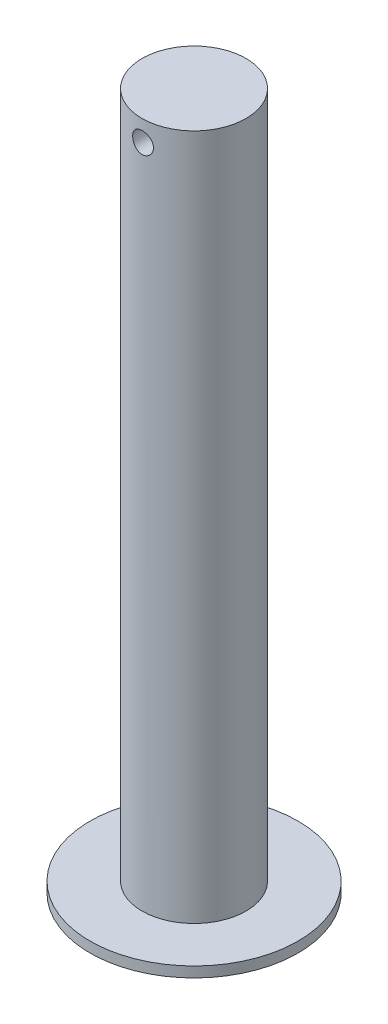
ISO-10303-21;
HEADER;
FILE_DESCRIPTION(('STEP AP214'),'2;1');
FILE_NAME('part.step','',(''),(''),'','','');
FILE_SCHEMA(('AUTOMOTIVE_DESIGN { 1 0 10303 214 1 1 1 1 }'));
ENDSEC;
DATA;
#1=APPLICATION_CONTEXT('core data for automotive mechanical design processes');
#2=APPLICATION_PROTOCOL_DEFINITION('international standard','automotive_design',2000,#1);
#3=PRODUCT_CONTEXT('',#1,'mechanical');
#4=PRODUCT('Part','Part','',(#3));
#5=PRODUCT_RELATED_PRODUCT_CATEGORY('part','',(#4));
#6=PRODUCT_DEFINITION_FORMATION('','',#4);
#7=PRODUCT_DEFINITION_CONTEXT('part definition',#1,'design');
#8=PRODUCT_DEFINITION('design','',#6,#7);
#9=PRODUCT_DEFINITION_SHAPE('','',#8);
#10=(LENGTH_UNIT() NAMED_UNIT(*) SI_UNIT(.MILLI.,.METRE.));
#11=(NAMED_UNIT(*) PLANE_ANGLE_UNIT() SI_UNIT($,.RADIAN.));
#12=(NAMED_UNIT(*) SI_UNIT($,.STERADIAN.) SOLID_ANGLE_UNIT());
#13=UNCERTAINTY_MEASURE_WITH_UNIT(LENGTH_MEASURE(1.E-05),#10,'distance_accuracy_value','');
#14=(GEOMETRIC_REPRESENTATION_CONTEXT(3) GLOBAL_UNCERTAINTY_ASSIGNED_CONTEXT((#13)) GLOBAL_UNIT_ASSIGNED_CONTEXT((#10,
#11,#12)) REPRESENTATION_CONTEXT('',''));
#15=CARTESIAN_POINT('',(0.,0.,0.));
#16=DIRECTION('',(0.,0.,1.));
#17=DIRECTION('',(1.,0.,0.));
#18=AXIS2_PLACEMENT_3D('',#15,#16,#17);
#19=CARTESIAN_POINT('',(0.,-1.27,0.));
#20=DIRECTION('',(0.,-1.,0.));
#21=DIRECTION('',(0.,0.,-1.));
#22=AXIS2_PLACEMENT_3D('',#19,#20,#21);
#23=CONICAL_SURFACE('',#22,10.31875,0.785398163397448);
#24=CARTESIAN_POINT('',(0.,0.,0.));
#25=DIRECTION('',(0.,1.,0.));
#26=DIRECTION('',(0.,0.,1.));
#27=AXIS2_PLACEMENT_3D('',#24,#25,#26);
#28=CIRCLE('',#27,9.04875000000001);
#29=CARTESIAN_POINT('',(0.,0.,9.04875000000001));
#30=VERTEX_POINT('',#29);
#31=EDGE_CURVE('E44',#30,#30,#28,.F.);
#32=ORIENTED_EDGE('',*,*,#31,.F.);
#33=EDGE_LOOP('',(#32));
#34=FACE_BOUND('',#33,.T.);
#35=CARTESIAN_POINT('',(0.,-1.27,0.));
#36=DIRECTION('',(0.,-1.,0.));
#37=DIRECTION('',(0.,0.,-1.));
#38=AXIS2_PLACEMENT_3D('',#35,#36,#37);
#39=CIRCLE('',#38,10.31875);
#40=CARTESIAN_POINT('',(0.,-1.27,-10.31875));
#41=VERTEX_POINT('',#40);
#42=EDGE_CURVE('E11',#41,#41,#39,.T.);
#43=ORIENTED_EDGE('',*,*,#42,.T.);
#44=EDGE_LOOP('',(#43));
#45=FACE_BOUND('',#44,.T.);
#46=ADVANCED_FACE('F38',(#34,#45),#23,.F.);
#47=CARTESIAN_POINT('',(0.,-2.54,0.));
#48=DIRECTION('',(0.,1.,0.));
#49=DIRECTION('',(0.,0.,1.));
#50=AXIS2_PLACEMENT_3D('',#47,#48,#49);
#51=CYLINDRICAL_SURFACE('',#50,10.31875);
#52=CARTESIAN_POINT('',(0.,0.,0.));
#53=DIRECTION('',(0.,1.,0.));
#54=DIRECTION('',(0.,0.,1.));
#55=AXIS2_PLACEMENT_3D('',#52,#53,#54);
#56=CIRCLE('',#55,10.31875);
#57=CARTESIAN_POINT('',(0.,0.,10.31875));
#58=VERTEX_POINT('',#57);
#59=EDGE_CURVE('E48',#58,#58,#56,.T.);
#60=ORIENTED_EDGE('',*,*,#59,.F.);
#61=EDGE_LOOP('',(#60));
#62=FACE_BOUND('',#61,.T.);
#63=ORIENTED_EDGE('',*,*,#42,.F.);
#64=EDGE_LOOP('',(#63));
#65=FACE_BOUND('',#64,.T.);
#66=ADVANCED_FACE('F57',(#62,#65),#51,.T.);
#67=CARTESIAN_POINT('',(0.,0.,0.));
#68=DIRECTION('',(0.,1.,0.));
#69=DIRECTION('',(0.,0.,1.));
#70=AXIS2_PLACEMENT_3D('',#67,#68,#69);
#71=PLANE('',#70);
#72=ORIENTED_EDGE('',*,*,#59,.T.);
#73=EDGE_LOOP('',(#72));
#74=FACE_BOUND('',#73,.T.);
#75=ORIENTED_EDGE('',*,*,#31,.T.);
#76=EDGE_LOOP('',(#75));
#77=FACE_BOUND('',#76,.T.);
#78=ADVANCED_FACE('F55',(#74,#77),#71,.T.);
#79=CLOSED_SHELL('',(#46,#66,#78));
#80=MANIFOLD_SOLID_BREP('B2',#79);
#81=CARTESIAN_POINT('',(0.,-2.54,0.));
#82=DIRECTION('',(0.,-1.,0.));
#83=DIRECTION('',(0.,0.,-1.));
#84=AXIS2_PLACEMENT_3D('',#81,#82,#83);
#85=PLANE('',#84);
#86=CARTESIAN_POINT('',(0.,-2.54,0.));
#87=DIRECTION('',(0.,-1.,0.));
#88=DIRECTION('',(0.,0.,-1.));
#89=AXIS2_PLACEMENT_3D('',#86,#87,#88);
#90=CIRCLE('',#89,25.4);
#91=CARTESIAN_POINT('',(0.,-2.54,-25.4));
#92=VERTEX_POINT('',#91);
#93=EDGE_CURVE('E37',#92,#92,#90,.T.);
#94=ORIENTED_EDGE('',*,*,#93,.T.);
#95=EDGE_LOOP('',(#94));
#96=FACE_BOUND('',#95,.T.);
#97=CARTESIAN_POINT('',(0.,-2.54,0.));
#98=DIRECTION('',(0.,-1.,0.));
#99=DIRECTION('',(0.,0.,-1.));
#100=AXIS2_PLACEMENT_3D('',#97,#98,#99);
#101=CIRCLE('',#100,10.31875);
#102=CARTESIAN_POINT('',(0.,-2.54,-10.31875));
#103=VERTEX_POINT('',#102);
#104=EDGE_CURVE('E103',#103,#103,#101,.T.);
#105=ORIENTED_EDGE('',*,*,#104,.F.);
#106=EDGE_LOOP('',(#105));
#107=FACE_BOUND('',#106,.T.);
#108=ADVANCED_FACE('F92',(#96,#107),#85,.T.);
#109=CARTESIAN_POINT('',(0.,0.,0.));
#110=DIRECTION('',(0.,-1.,0.));
#111=DIRECTION('',(0.,0.,-1.));
#112=AXIS2_PLACEMENT_3D('',#109,#110,#111);
#113=PLANE('',#112);
#114=CARTESIAN_POINT('',(0.,0.,0.));
#115=DIRECTION('',(0.,-1.,0.));
#116=DIRECTION('',(0.,0.,-1.));
#117=AXIS2_PLACEMENT_3D('',#114,#115,#116);
#118=CIRCLE('',#117,25.4);
#119=CARTESIAN_POINT('',(0.,0.,-25.4));
#120=VERTEX_POINT('',#119);
#121=EDGE_CURVE('E96',#120,#120,#118,.T.);
#122=ORIENTED_EDGE('',*,*,#121,.F.);
#123=EDGE_LOOP('',(#122));
#124=FACE_BOUND('',#123,.T.);
#125=CARTESIAN_POINT('',(0.,0.,0.));
#126=DIRECTION('',(0.,-1.,0.));
#127=DIRECTION('',(0.,0.,-1.));
#128=AXIS2_PLACEMENT_3D('',#125,#126,#127);
#129=CIRCLE('',#128,10.31875);
#130=CARTESIAN_POINT('',(0.,0.,-10.31875));
#131=VERTEX_POINT('',#130);
#132=EDGE_CURVE('E105',#131,#131,#129,.T.);
#133=ORIENTED_EDGE('',*,*,#132,.T.);
#134=EDGE_LOOP('',(#133));
#135=FACE_BOUND('',#134,.T.);
#136=ADVANCED_FACE('F115',(#124,#135),#113,.F.);
#137=CARTESIAN_POINT('',(0.,-2.54,0.));
#138=DIRECTION('',(0.,1.,0.));
#139=DIRECTION('',(0.,0.,1.));
#140=AXIS2_PLACEMENT_3D('',#137,#138,#139);
#141=CYLINDRICAL_SURFACE('',#140,25.4);
#142=ORIENTED_EDGE('',*,*,#93,.F.);
#143=EDGE_LOOP('',(#142));
#144=FACE_BOUND('',#143,.T.);
#145=ORIENTED_EDGE('',*,*,#121,.T.);
#146=EDGE_LOOP('',(#145));
#147=FACE_BOUND('',#146,.T.);
#148=ADVANCED_FACE('F94',(#144,#147),#141,.T.);
#149=CARTESIAN_POINT('',(0.,-2.54,0.));
#150=DIRECTION('',(0.,1.,0.));
#151=DIRECTION('',(0.,0.,1.));
#152=AXIS2_PLACEMENT_3D('',#149,#150,#151);
#153=CYLINDRICAL_SURFACE('',#152,10.31875);
#154=ORIENTED_EDGE('',*,*,#104,.T.);
#155=EDGE_LOOP('',(#154));
#156=FACE_BOUND('',#155,.T.);
#157=ORIENTED_EDGE('',*,*,#132,.F.);
#158=EDGE_LOOP('',(#157));
#159=FACE_BOUND('',#158,.T.);
#160=ADVANCED_FACE('F111',(#156,#159),#153,.F.);
#161=CLOSED_SHELL('',(#108,#136,#148,#160));
#162=MANIFOLD_SOLID_BREP('B6',#161);
#163=CARTESIAN_POINT('',(0.,167.64,0.));
#164=DIRECTION('',(0.,-1.,0.));
#165=DIRECTION('',(0.,0.,-1.));
#166=AXIS2_PLACEMENT_3D('',#163,#164,#165);
#167=CYLINDRICAL_SURFACE('',#166,12.7);
#168=CARTESIAN_POINT('',(0.,165.1,-12.7));
#169=CARTESIAN_POINT('',(-0.141165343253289,165.099994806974,-12.6999973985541));
#170=CARTESIAN_POINT('',(-0.282396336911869,165.088191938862,-12.6976221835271));
#171=CARTESIAN_POINT('',(-0.560866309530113,165.041329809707,-12.6883760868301));
#172=CARTESIAN_POINT('',(-0.698102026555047,165.006252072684,-12.6815016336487));
#173=CARTESIAN_POINT('',(-0.96451497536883,164.913967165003,-12.6640246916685));
#174=CARTESIAN_POINT('',(-1.09369978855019,164.856781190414,-12.6534257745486));
#175=CARTESIAN_POINT('',(-1.34063229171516,164.721966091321,-12.629652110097));
#176=CARTESIAN_POINT('',(-1.45838066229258,164.644338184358,-12.616477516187));
#177=CARTESIAN_POINT('',(-1.68070143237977,164.4697282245,-12.5888029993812));
#178=CARTESIAN_POINT('',(-1.78509663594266,164.372522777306,-12.5742889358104));
#179=CARTESIAN_POINT('',(-1.9762133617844,164.161997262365,-12.5456741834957));
#180=CARTESIAN_POINT('',(-2.0629335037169,164.048675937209,-12.5315735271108));
#181=CARTESIAN_POINT('',(-2.21699265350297,163.80786086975,-12.5052440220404));
#182=CARTESIAN_POINT('',(-2.28414818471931,163.680247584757,-12.4930333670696));
#183=CARTESIAN_POINT('',(-2.39599639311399,163.41526417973,-12.4720672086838));
#184=CARTESIAN_POINT('',(-2.4406912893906,163.2778950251,-12.4633113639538));
#185=CARTESIAN_POINT('',(-2.50577426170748,162.999205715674,-12.450389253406));
#186=CARTESIAN_POINT('',(-2.52647322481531,162.857960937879,-12.4461643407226));
#187=CARTESIAN_POINT('',(-2.54394240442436,162.573945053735,-12.4426059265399));
#188=CARTESIAN_POINT('',(-2.54071506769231,162.431174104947,-12.4432719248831));
#189=CARTESIAN_POINT('',(-2.51067461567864,162.150433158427,-12.4493667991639));
#190=CARTESIAN_POINT('',(-2.48421789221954,162.012423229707,-12.4547237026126));
#191=CARTESIAN_POINT('',(-2.40903222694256,161.742841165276,-12.469483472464));
#192=CARTESIAN_POINT('',(-2.36030222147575,161.611269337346,-12.4788865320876));
#193=CARTESIAN_POINT('',(-2.24161295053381,161.357271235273,-12.5007527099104));
#194=CARTESIAN_POINT('',(-2.17151242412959,161.234912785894,-12.5132360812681));
#195=CARTESIAN_POINT('',(-2.01217167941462,161.003562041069,-12.5398433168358));
#196=CARTESIAN_POINT('',(-1.92292926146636,160.894571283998,-12.5539673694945));
#197=CARTESIAN_POINT('',(-1.7259298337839,160.690993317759,-12.5825763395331));
#198=CARTESIAN_POINT('',(-1.61786864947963,160.596700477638,-12.597063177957));
#199=CARTESIAN_POINT('',(-1.38730996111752,160.427533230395,-12.624532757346));
#200=CARTESIAN_POINT('',(-1.26481227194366,160.352659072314,-12.6375154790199));
#201=CARTESIAN_POINT('',(-1.00853084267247,160.224400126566,-12.6605459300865));
#202=CARTESIAN_POINT('',(-0.874729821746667,160.171048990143,-12.6705890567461));
#203=CARTESIAN_POINT('',(-0.59981840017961,160.087664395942,-12.6865737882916));
#204=CARTESIAN_POINT('',(-0.458708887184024,160.057628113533,-12.6925158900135));
#205=CARTESIAN_POINT('',(-0.175715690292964,160.022142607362,-12.6995598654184));
#206=CARTESIAN_POINT('',(-0.0338844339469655,160.016290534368,-12.7007410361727));
#207=CARTESIAN_POINT('',(0.248729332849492,160.028254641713,-12.6983503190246));
#208=CARTESIAN_POINT('',(0.389511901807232,160.046069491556,-12.6947786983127));
#209=CARTESIAN_POINT('',(0.664732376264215,160.104527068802,-12.6833333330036));
#210=CARTESIAN_POINT('',(0.799215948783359,160.144963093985,-12.6754985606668));
#211=CARTESIAN_POINT('',(1.05949401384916,160.247289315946,-12.6564022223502));
#212=CARTESIAN_POINT('',(1.18528785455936,160.309181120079,-12.6451403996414));
#213=CARTESIAN_POINT('',(1.426314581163,160.453533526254,-12.6202417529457));
#214=CARTESIAN_POINT('',(1.54139932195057,160.536236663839,-12.6065775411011));
#215=CARTESIAN_POINT('',(1.7562017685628,160.719539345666,-12.578454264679));
#216=CARTESIAN_POINT('',(1.85591782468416,160.820140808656,-12.5639951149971));
#217=CARTESIAN_POINT('',(2.03870710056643,161.038218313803,-12.5356443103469));
#218=CARTESIAN_POINT('',(2.12150376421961,161.155927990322,-12.5217646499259));
#219=CARTESIAN_POINT('',(2.26615096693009,161.403820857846,-12.4963984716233));
#220=CARTESIAN_POINT('',(2.3280023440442,161.534003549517,-12.4849118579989));
#221=CARTESIAN_POINT('',(2.4286256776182,161.80249134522,-12.4657292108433));
#222=CARTESIAN_POINT('',(2.46751728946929,161.940750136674,-12.4580135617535));
#223=CARTESIAN_POINT('',(2.5214799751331,162.222010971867,-12.4472048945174));
#224=CARTESIAN_POINT('',(2.5365541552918,162.365012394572,-12.4441112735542));
#225=CARTESIAN_POINT('',(2.54233911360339,162.648922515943,-12.442930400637));
#226=CARTESIAN_POINT('',(2.53348690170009,162.789822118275,-12.4447533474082));
#227=CARTESIAN_POINT('',(2.49263485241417,163.068080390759,-12.4529995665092));
#228=CARTESIAN_POINT('',(2.46063520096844,163.205439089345,-12.4594228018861));
#229=CARTESIAN_POINT('',(2.37459156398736,163.472438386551,-12.4761057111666));
#230=CARTESIAN_POINT('',(2.32060116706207,163.602096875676,-12.4863560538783));
#231=CARTESIAN_POINT('',(2.19215879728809,163.850583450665,-12.5095435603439));
#232=CARTESIAN_POINT('',(2.11770510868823,163.969410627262,-12.5224809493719));
#233=CARTESIAN_POINT('',(1.94895702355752,164.195037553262,-12.5498595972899));
#234=CARTESIAN_POINT('',(1.85434703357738,164.30159866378,-12.5643226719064));
#235=CARTESIAN_POINT('',(1.64862349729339,164.497476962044,-12.5929664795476));
#236=CARTESIAN_POINT('',(1.53750616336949,164.586790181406,-12.6071471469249));
#237=CARTESIAN_POINT('',(1.30052477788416,164.746519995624,-12.6338033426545));
#238=CARTESIAN_POINT('',(1.17451856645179,164.816729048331,-12.6462594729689));
#239=CARTESIAN_POINT('',(0.912282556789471,164.934864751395,-12.667872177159));
#240=CARTESIAN_POINT('',(0.776062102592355,164.982811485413,-12.6770317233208));
#241=CARTESIAN_POINT('',(0.532946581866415,165.045775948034,-12.6892398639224));
#242=CARTESIAN_POINT('',(0.427435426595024,165.066073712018,-12.6932513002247));
#243=CARTESIAN_POINT('',(0.214628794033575,165.09318749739,-12.6986323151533));
#244=CARTESIAN_POINT('',(0.107333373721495,165.100003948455,-12.7000019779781));
#245=CARTESIAN_POINT('',(0.,165.1,-12.7));
#246=B_SPLINE_CURVE_WITH_KNOTS('',3,(#168,#169,#170,#171,#172,#173,#174,#175,#176,#177,#178,
#179,#180,#181,#182,#183,#184,#185,#186,#187,#188,#189,#190,#191,#192,#193,#194,#195,#196,#197,
#198,#199,#200,#201,#202,#203,#204,#205,#206,#207,#208,#209,#210,#211,#212,#213,#214,#215,#216,
#217,#218,#219,#220,#221,#222,#223,#224,#225,#226,#227,#228,#229,#230,#231,#232,#233,#234,#235,
#236,#237,#238,#239,#240,#241,#242,#243,#244,#245),.UNSPECIFIED.,.T.,.F.,(4,2,2,2,2,2,2,2,2,2,2,
2,2,2,2,2,2,2,2,2,2,2,2,2,2,2,2,2,2,2,2,2,2,2,2,2,2,2,4),(0.,0.423103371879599,
0.846543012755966,1.26957768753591,1.69258717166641,2.12072898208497,2.54890421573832,
2.98097435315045,3.41300179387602,3.83936710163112,4.26568880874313,4.68558186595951,
5.10549497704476,5.52824625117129,5.95104613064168,6.38145161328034,6.81186261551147,
7.24294398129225,7.67397311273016,8.09779268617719,8.52158843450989,8.94157353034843,
9.36159009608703,9.78674867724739,10.2119528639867,10.6436319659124,11.0752937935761,
11.5046856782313,11.9340215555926,12.3555689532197,12.7771129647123,13.1976358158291,
13.6181939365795,14.0458971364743,14.4736986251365,14.9059772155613,15.3378650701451,
15.6595768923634,15.9812784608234),.UNSPECIFIED.);
#247=CARTESIAN_POINT('',(0.,165.1,-12.7));
#248=VERTEX_POINT('',#247);
#249=EDGE_CURVE('E91',#248,#248,#246,.T.);
#250=ORIENTED_EDGE('',*,*,#249,.T.);
#251=EDGE_LOOP('',(#250));
#252=FACE_BOUND('',#251,.T.);
#253=CARTESIAN_POINT('',(2.54000000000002,162.56,12.4434078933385));
#254=CARTESIAN_POINT('',(2.53999478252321,162.418866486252,12.4434106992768));
#255=CARTESIAN_POINT('',(2.52819705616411,162.277667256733,12.445835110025));
#256=CARTESIAN_POINT('',(2.48135720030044,161.999263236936,12.4552565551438));
#257=CARTESIAN_POINT('',(2.44629647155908,161.862061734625,12.4622572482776));
#258=CARTESIAN_POINT('',(2.35406128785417,161.59572124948,12.4800073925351));
#259=CARTESIAN_POINT('',(2.29690882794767,161.466574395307,12.4907531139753));
#260=CARTESIAN_POINT('',(2.1621727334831,161.21970589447,12.5147781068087));
#261=CARTESIAN_POINT('',(2.08459023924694,161.101983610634,12.5280572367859));
#262=CARTESIAN_POINT('',(1.91002685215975,160.879635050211,12.555862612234));
#263=CARTESIAN_POINT('',(1.81281236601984,160.775193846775,12.5704025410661));
#264=CARTESIAN_POINT('',(1.60224924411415,160.583987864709,12.598970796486));
#265=CARTESIAN_POINT('',(1.48889947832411,160.49722432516,12.6129990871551));
#266=CARTESIAN_POINT('',(1.24805784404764,160.343118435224,12.6391110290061));
#267=CARTESIAN_POINT('',(1.12045132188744,160.275951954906,12.6511766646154));
#268=CARTESIAN_POINT('',(0.855482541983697,160.164081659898,12.6718501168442));
#269=CARTESIAN_POINT('',(0.718121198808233,160.119375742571,12.6804582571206));
#270=CARTESIAN_POINT('',(0.439462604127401,160.054271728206,12.6931501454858));
#271=CARTESIAN_POINT('',(0.29824105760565,160.03356111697,12.6972920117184));
#272=CARTESIAN_POINT('',(0.0142711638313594,160.016060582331,12.7007853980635));
#273=CARTESIAN_POINT('',(-0.128477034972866,160.0192683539,12.7001373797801));
#274=CARTESIAN_POINT('',(-0.409300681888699,160.049276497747,12.6941690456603));
#275=CARTESIAN_POINT('',(-0.547413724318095,160.075740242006,12.6889153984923));
#276=CARTESIAN_POINT('',(-0.817198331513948,160.150975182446,12.674401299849));
#277=CARTESIAN_POINT('',(-0.948869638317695,160.199747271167,12.6651406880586));
#278=CARTESIAN_POINT('',(-1.20299343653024,160.318526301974,12.6435433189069));
#279=CARTESIAN_POINT('',(-1.32538260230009,160.388665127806,12.6311875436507));
#280=CARTESIAN_POINT('',(-1.55677881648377,160.548089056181,12.6047619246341));
#281=CARTESIAN_POINT('',(-1.6657843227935,160.637376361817,12.5906918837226));
#282=CARTESIAN_POINT('',(-1.86931663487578,160.834409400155,12.5621024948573));
#283=CARTESIAN_POINT('',(-1.96355796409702,160.942449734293,12.5475795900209));
#284=CARTESIAN_POINT('',(-2.13263097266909,161.172947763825,12.5199539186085));
#285=CARTESIAN_POINT('',(-2.20746228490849,161.295405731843,12.5068511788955));
#286=CARTESIAN_POINT('',(-2.33568954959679,161.551672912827,12.4835424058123));
#287=CARTESIAN_POINT('',(-2.3890392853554,161.685505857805,12.4733426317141));
#288=CARTESIAN_POINT('',(-2.47241146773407,161.960487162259,12.4570864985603));
#289=CARTESIAN_POINT('',(-2.50243695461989,162.101634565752,12.4510295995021));
#290=CARTESIAN_POINT('',(-2.53788165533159,162.384650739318,12.4438531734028));
#291=CARTESIAN_POINT('',(-2.54371312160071,162.526465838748,12.4426509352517));
#292=CARTESIAN_POINT('',(-2.5317135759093,162.809042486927,12.4450979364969));
#293=CARTESIAN_POINT('',(-2.51388390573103,162.949804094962,12.4487469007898));
#294=CARTESIAN_POINT('',(-2.45542360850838,163.224892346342,12.4604077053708));
#295=CARTESIAN_POINT('',(-2.41501325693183,163.359267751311,12.4683773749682));
#296=CARTESIAN_POINT('',(-2.31277422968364,163.619340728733,12.4877446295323));
#297=CARTESIAN_POINT('',(-2.25094378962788,163.745037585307,12.4991424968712));
#298=CARTESIAN_POINT('',(-2.10668652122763,163.985989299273,12.5242677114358));
#299=CARTESIAN_POINT('',(-2.02400173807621,164.101086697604,12.5380234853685));
#300=CARTESIAN_POINT('',(-1.8407267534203,164.315923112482,12.5662365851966));
#301=CARTESIAN_POINT('',(-1.74013470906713,164.415660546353,12.580693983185));
#302=CARTESIAN_POINT('',(-1.52204997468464,164.598508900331,12.6089497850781));
#303=CARTESIAN_POINT('',(-1.40432154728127,164.681341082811,12.6227346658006));
#304=CARTESIAN_POINT('',(-1.15638045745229,164.826050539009,12.6478570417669));
#305=CARTESIAN_POINT('',(-1.02616831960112,164.887928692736,12.6591946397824));
#306=CARTESIAN_POINT('',(-0.757688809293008,164.988567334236,12.6780872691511));
#307=CARTESIAN_POINT('',(-0.619472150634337,165.027458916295,12.6856637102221));
#308=CARTESIAN_POINT('',(-0.338301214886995,165.081435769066,12.6962721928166));
#309=CARTESIAN_POINT('',(-0.195347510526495,165.096523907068,12.6993047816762));
#310=CARTESIAN_POINT('',(0.0885771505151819,165.102354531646,12.7004709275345));
#311=CARTESIAN_POINT('',(0.229539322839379,165.093516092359,12.698688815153));
#312=CARTESIAN_POINT('',(0.507926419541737,165.052669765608,12.6906031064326));
#313=CARTESIAN_POINT('',(0.645351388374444,165.020662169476,12.6842995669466));
#314=CARTESIAN_POINT('',(0.912501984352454,164.934572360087,12.667881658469));
#315=CARTESIAN_POINT('',(1.04224440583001,164.880540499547,12.6577759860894));
#316=CARTESIAN_POINT('',(1.29088189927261,164.751988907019,12.6348419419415));
#317=CARTESIAN_POINT('',(1.40977611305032,164.677467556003,12.6220133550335));
#318=CARTESIAN_POINT('',(1.63541428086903,164.508638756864,12.5947830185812));
#319=CARTESIAN_POINT('',(1.74193127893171,164.414031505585,12.5803592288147));
#320=CARTESIAN_POINT('',(1.93772184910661,164.208332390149,12.5516950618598));
#321=CARTESIAN_POINT('',(2.02699133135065,164.097236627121,12.5374547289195));
#322=CARTESIAN_POINT('',(2.18666623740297,163.860278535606,12.5106009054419));
#323=CARTESIAN_POINT('',(2.25685810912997,163.734270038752,12.4980065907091));
#324=CARTESIAN_POINT('',(2.37496108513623,163.472030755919,12.4761050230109));
#325=CARTESIAN_POINT('',(2.42289240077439,163.335809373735,12.4667947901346));
#326=CARTESIAN_POINT('',(2.48581961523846,163.092733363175,12.4543739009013));
#327=CARTESIAN_POINT('',(2.50610090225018,162.987265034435,12.450287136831));
#328=CARTESIAN_POINT('',(2.53319284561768,162.77454375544,12.4448031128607));
#329=CARTESIAN_POINT('',(2.54000396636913,162.667290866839,12.443405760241));
#330=CARTESIAN_POINT('',(2.54000000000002,162.56,12.4434078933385));
#331=B_SPLINE_CURVE_WITH_KNOTS('',3,(#253,#254,#255,#256,#257,#258,#259,#260,#261,#262,#263,
#264,#265,#266,#267,#268,#269,#270,#271,#272,#273,#274,#275,#276,#277,#278,#279,#280,#281,#282,
#283,#284,#285,#286,#287,#288,#289,#290,#291,#292,#293,#294,#295,#296,#297,#298,#299,#300,#301,
#302,#303,#304,#305,#306,#307,#308,#309,#310,#311,#312,#313,#314,#315,#316,#317,#318,#319,#320,
#321,#322,#323,#324,#325,#326,#327,#328,#329,#330),.UNSPECIFIED.,.T.,.F.,(4,2,2,2,2,2,2,2,2,2,2,
2,2,2,2,2,2,2,2,2,2,2,2,2,2,2,2,2,2,2,2,2,2,2,2,2,2,2,4),(0.,0.42300769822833,0.846354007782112,
1.26927990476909,1.69218220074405,2.1204492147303,2.54874623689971,2.98077637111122,
3.41276605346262,3.83906392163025,4.26532070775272,4.68550725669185,5.10571061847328,
5.52856207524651,5.95146220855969,6.38173340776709,6.81201274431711,7.24321292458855,
7.67435688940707,8.09812344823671,8.52186597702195,8.94154528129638,9.36125916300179,
9.78644371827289,10.2116720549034,10.6434280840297,11.0751659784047,11.5044172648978,
11.9336168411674,12.3553478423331,12.7770735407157,13.1978404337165,13.618640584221,
14.0462292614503,14.4739192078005,14.9062160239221,15.3381195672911,15.6597046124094,
15.9812785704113),.UNSPECIFIED.);
#332=CARTESIAN_POINT('',(2.54000000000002,162.56,12.4434078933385));
#333=VERTEX_POINT('',#332);
#334=EDGE_CURVE('E164',#333,#333,#331,.T.);
#335=ORIENTED_EDGE('',*,*,#334,.T.);
#336=EDGE_LOOP('',(#335));
#337=FACE_BOUND('',#336,.T.);
#338=CARTESIAN_POINT('',(0.,167.64,0.));
#339=DIRECTION('',(0.,1.,0.));
#340=DIRECTION('',(0.,0.,1.));
#341=AXIS2_PLACEMENT_3D('',#338,#339,#340);
#342=CIRCLE('',#341,12.7);
#343=CARTESIAN_POINT('',(0.,167.64,12.7));
#344=VERTEX_POINT('',#343);
#345=EDGE_CURVE('E168',#344,#344,#342,.T.);
#346=ORIENTED_EDGE('',*,*,#345,.F.);
#347=EDGE_LOOP('',(#346));
#348=FACE_BOUND('',#347,.T.);
#349=CARTESIAN_POINT('',(0.,0.,0.));
#350=DIRECTION('',(0.,1.,0.));
#351=DIRECTION('',(0.,0.,1.));
#352=AXIS2_PLACEMENT_3D('',#349,#350,#351);
#353=CIRCLE('',#352,12.7);
#354=CARTESIAN_POINT('',(0.,0.,12.7));
#355=VERTEX_POINT('',#354);
#356=EDGE_CURVE('E172',#355,#355,#353,.T.);
#357=ORIENTED_EDGE('',*,*,#356,.T.);
#358=EDGE_LOOP('',(#357));
#359=FACE_BOUND('',#358,.T.);
#360=ADVANCED_FACE('F154',(#252,#337,#348,#359),#167,.T.);
#361=CARTESIAN_POINT('',(0.,167.64,0.));
#362=DIRECTION('',(0.,1.,0.));
#363=DIRECTION('',(0.,0.,1.));
#364=AXIS2_PLACEMENT_3D('',#361,#362,#363);
#365=PLANE('',#364);
#366=ORIENTED_EDGE('',*,*,#345,.T.);
#367=EDGE_LOOP('',(#366));
#368=FACE_BOUND('',#367,.T.);
#369=ADVANCED_FACE('F183',(#368),#365,.T.);
#370=CARTESIAN_POINT('',(0.,0.,0.));
#371=DIRECTION('',(0.,1.,0.));
#372=DIRECTION('',(0.,0.,1.));
#373=AXIS2_PLACEMENT_3D('',#370,#371,#372);
#374=PLANE('',#373);
#375=ORIENTED_EDGE('',*,*,#356,.F.);
#376=EDGE_LOOP('',(#375));
#377=FACE_BOUND('',#376,.T.);
#378=ADVANCED_FACE('F181',(#377),#374,.F.);
#379=CARTESIAN_POINT('',(0.,162.56,-12.7));
#380=DIRECTION('',(0.,0.,1.));
#381=DIRECTION('',(1.,0.,0.));
#382=AXIS2_PLACEMENT_3D('',#379,#380,#381);
#383=CYLINDRICAL_SURFACE('',#382,2.54000000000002);
#384=ORIENTED_EDGE('',*,*,#334,.F.);
#385=EDGE_LOOP('',(#384));
#386=FACE_BOUND('',#385,.T.);
#387=ORIENTED_EDGE('',*,*,#249,.F.);
#388=EDGE_LOOP('',(#387));
#389=FACE_BOUND('',#388,.T.);
#390=ADVANCED_FACE('F177',(#386,#389),#383,.F.);
#391=CLOSED_SHELL('',(#360,#369,#378,#390));
#392=MANIFOLD_SOLID_BREP('B32',#391);
#393=ADVANCED_BREP_SHAPE_REPRESENTATION('',(#18,#80,#162,#392),#14);
#394=SHAPE_DEFINITION_REPRESENTATION(#9,#393);
ENDSEC;
END-ISO-10303-21;
